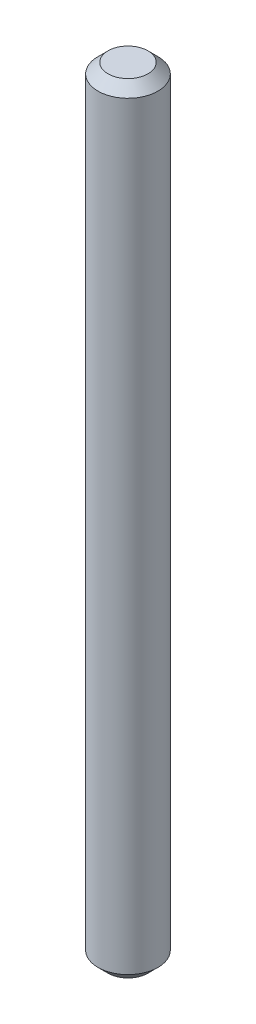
from build123d import *

# Parameters (mm, degrees)
ESQUISSE1_R      = 3
EXTRUSION1_DEPTH = 39
CHANFREIN1_SIZE  = 1


with BuildPart() as part:
    # Esquisse1 → Extrusion1 (new, symmetric)
    with BuildSketch(Plane(origin=(0, 0, 0), x_dir=(1, 0, 0), z_dir=(0, 1, 0))):
        with Locations(Location((0, 0, 0), (0, 0, 270))):
            Circle(ESQUISSE1_R)
    extrude(amount=EXTRUSION1_DEPTH, both=True)

    # Chanfrein1
    chanfrein1_edges = [part.edges().sort_by_distance(p)[0] for p in [
        (0, -39, -3),
        (0, 39, -3),
    ]]
    chamfer(chanfrein1_edges, length=CHANFREIN1_SIZE)


solid = part.part
